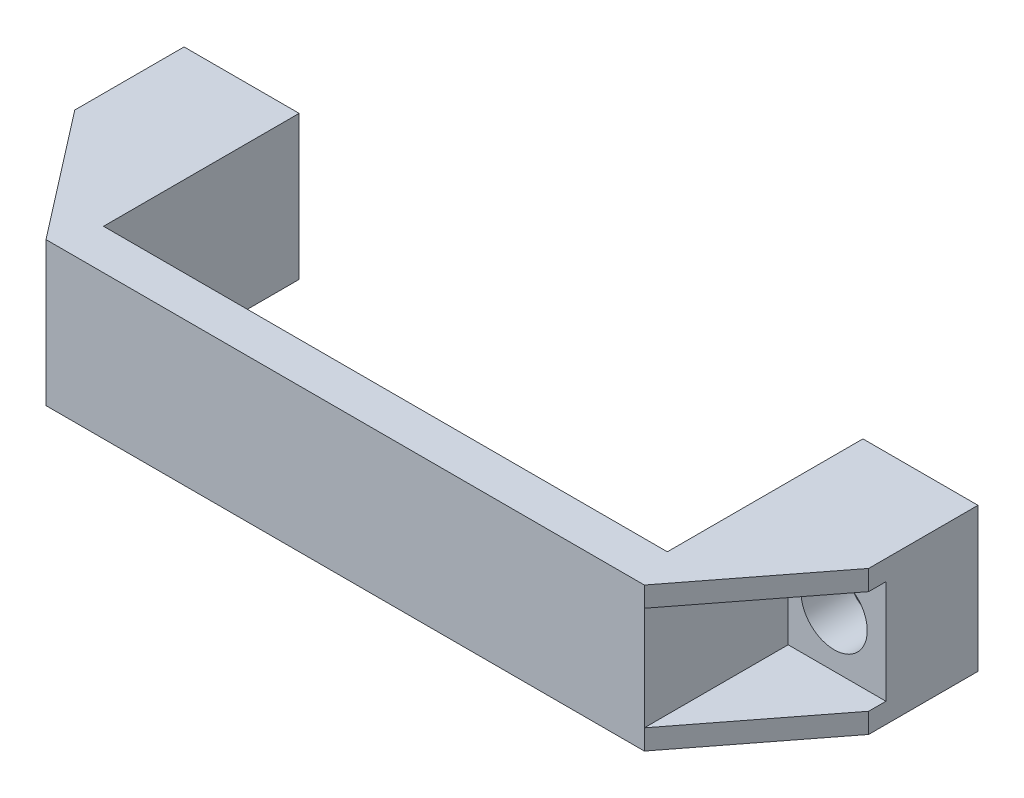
ISO-10303-21;
HEADER;
FILE_DESCRIPTION(('STEP AP214'),'2;1');
FILE_NAME('part.step','',(''),(''),'','','');
FILE_SCHEMA(('AUTOMOTIVE_DESIGN { 1 0 10303 214 1 1 1 1 }'));
ENDSEC;
DATA;
#1=APPLICATION_CONTEXT('core data for automotive mechanical design processes');
#2=APPLICATION_PROTOCOL_DEFINITION('international standard','automotive_design',2000,#1);
#3=PRODUCT_CONTEXT('',#1,'mechanical');
#4=PRODUCT('Part','Part','',(#3));
#5=PRODUCT_RELATED_PRODUCT_CATEGORY('part','',(#4));
#6=PRODUCT_DEFINITION_FORMATION('','',#4);
#7=PRODUCT_DEFINITION_CONTEXT('part definition',#1,'design');
#8=PRODUCT_DEFINITION('design','',#6,#7);
#9=PRODUCT_DEFINITION_SHAPE('','',#8);
#10=(LENGTH_UNIT() NAMED_UNIT(*) SI_UNIT(.MILLI.,.METRE.));
#11=(NAMED_UNIT(*) PLANE_ANGLE_UNIT() SI_UNIT($,.RADIAN.));
#12=(NAMED_UNIT(*) SI_UNIT($,.STERADIAN.) SOLID_ANGLE_UNIT());
#13=UNCERTAINTY_MEASURE_WITH_UNIT(LENGTH_MEASURE(1.E-05),#10,'distance_accuracy_value','');
#14=(GEOMETRIC_REPRESENTATION_CONTEXT(3) GLOBAL_UNCERTAINTY_ASSIGNED_CONTEXT((#13)) GLOBAL_UNIT_ASSIGNED_CONTEXT((#10,
#11,#12)) REPRESENTATION_CONTEXT('',''));
#15=CARTESIAN_POINT('',(0.,0.,0.));
#16=DIRECTION('',(0.,0.,1.));
#17=DIRECTION('',(1.,0.,0.));
#18=AXIS2_PLACEMENT_3D('',#15,#16,#17);
#19=CARTESIAN_POINT('',(60.,0.,20.5));
#20=DIRECTION('',(0.,0.,-1.));
#21=DIRECTION('',(-1.,0.,0.));
#22=AXIS2_PLACEMENT_3D('',#19,#20,#21);
#23=CYLINDRICAL_SURFACE('',#22,3.25);
#24=CARTESIAN_POINT('',(60.,0.,-20.5));
#25=DIRECTION('',(0.,0.,-1.));
#26=DIRECTION('',(-1.,0.,0.));
#27=AXIS2_PLACEMENT_3D('',#24,#25,#26);
#28=CIRCLE('',#27,3.25);
#29=CARTESIAN_POINT('',(56.75,0.,-20.5));
#30=VERTEX_POINT('',#29);
#31=EDGE_CURVE('E215',#30,#30,#28,.T.);
#32=ORIENTED_EDGE('',*,*,#31,.T.);
#33=EDGE_LOOP('',(#32));
#34=FACE_BOUND('',#33,.T.);
#35=CARTESIAN_POINT('',(60.,0.,-12.5));
#36=DIRECTION('',(0.,0.,1.));
#37=DIRECTION('',(1.,0.,0.));
#38=AXIS2_PLACEMENT_3D('',#35,#36,#37);
#39=CIRCLE('',#38,3.25);
#40=CARTESIAN_POINT('',(63.25,0.,-12.5));
#41=VERTEX_POINT('',#40);
#42=EDGE_CURVE('E37',#41,#41,#39,.F.);
#43=ORIENTED_EDGE('',*,*,#42,.F.);
#44=EDGE_LOOP('',(#43));
#45=FACE_BOUND('',#44,.T.);
#46=ADVANCED_FACE('F33',(#34,#45),#23,.F.);
#47=CARTESIAN_POINT('',(-60.,0.,20.5));
#48=DIRECTION('',(0.,0.,-1.));
#49=DIRECTION('',(-1.,0.,0.));
#50=AXIS2_PLACEMENT_3D('',#47,#48,#49);
#51=CYLINDRICAL_SURFACE('',#50,3.25000000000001);
#52=CARTESIAN_POINT('',(-60.,0.,-20.5));
#53=DIRECTION('',(0.,0.,-1.));
#54=DIRECTION('',(-1.,0.,0.));
#55=AXIS2_PLACEMENT_3D('',#52,#53,#54);
#56=CIRCLE('',#55,3.25000000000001);
#57=CARTESIAN_POINT('',(-63.25,0.,-20.5));
#58=VERTEX_POINT('',#57);
#59=EDGE_CURVE('E208',#58,#58,#56,.T.);
#60=ORIENTED_EDGE('',*,*,#59,.T.);
#61=EDGE_LOOP('',(#60));
#62=FACE_BOUND('',#61,.T.);
#63=CARTESIAN_POINT('',(-60.,0.,-12.5));
#64=DIRECTION('',(0.,0.,1.));
#65=DIRECTION('',(1.,0.,0.));
#66=AXIS2_PLACEMENT_3D('',#63,#64,#65);
#67=CIRCLE('',#66,3.25000000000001);
#68=CARTESIAN_POINT('',(-56.75,0.,-12.5));
#69=VERTEX_POINT('',#68);
#70=EDGE_CURVE('E303',#69,#69,#67,.F.);
#71=ORIENTED_EDGE('',*,*,#70,.F.);
#72=EDGE_LOOP('',(#71));
#73=FACE_BOUND('',#72,.T.);
#74=ADVANCED_FACE('F386',(#62,#73),#51,.F.);
#75=CARTESIAN_POINT('',(69.,12.5,20.5));
#76=DIRECTION('',(-1.,0.,0.));
#77=DIRECTION('',(0.,0.,1.));
#78=AXIS2_PLACEMENT_3D('',#75,#76,#77);
#79=PLANE('',#78);
#80=DIRECTION('',(0.,0.,1.));
#81=VECTOR('',#80,1.);
#82=CARTESIAN_POINT('',(69.,-9.00000000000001,-4.5));
#83=LINE('',#82,#81);
#84=CARTESIAN_POINT('',(69.,-9.00000000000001,-4.5));
#85=VERTEX_POINT('',#84);
#86=CARTESIAN_POINT('',(69.,-9.00000000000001,-1.49999999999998));
#87=VERTEX_POINT('',#86);
#88=EDGE_CURVE('E204',#85,#87,#83,.T.);
#89=ORIENTED_EDGE('',*,*,#88,.T.);
#90=DIRECTION('',(0.,-1.,0.));
#91=VECTOR('',#90,1.);
#92=CARTESIAN_POINT('',(69.,12.5,-1.49999999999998));
#93=LINE('',#92,#91);
#94=CARTESIAN_POINT('',(69.,-12.5,-1.49999999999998));
#95=VERTEX_POINT('',#94);
#96=EDGE_CURVE('E227',#87,#95,#93,.T.);
#97=ORIENTED_EDGE('',*,*,#96,.T.);
#98=DIRECTION('',(0.,0.,-1.));
#99=VECTOR('',#98,1.);
#100=CARTESIAN_POINT('',(69.,-12.5,20.5));
#101=LINE('',#100,#99);
#102=CARTESIAN_POINT('',(69.,-12.5,-20.5));
#103=VERTEX_POINT('',#102);
#104=EDGE_CURVE('E293',#95,#103,#101,.T.);
#105=ORIENTED_EDGE('',*,*,#104,.T.);
#106=DIRECTION('',(0.,1.,0.));
#107=VECTOR('',#106,1.);
#108=CARTESIAN_POINT('',(69.,12.5,-20.5));
#109=LINE('',#108,#107);
#110=CARTESIAN_POINT('',(69.,12.5,-20.5));
#111=VERTEX_POINT('',#110);
#112=EDGE_CURVE('E284',#103,#111,#109,.T.);
#113=ORIENTED_EDGE('',*,*,#112,.T.);
#114=DIRECTION('',(0.,0.,-1.));
#115=VECTOR('',#114,1.);
#116=CARTESIAN_POINT('',(69.,12.5,20.5));
#117=LINE('',#116,#115);
#118=CARTESIAN_POINT('',(69.,12.5,-1.49999999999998));
#119=VERTEX_POINT('',#118);
#120=EDGE_CURVE('E291',#119,#111,#117,.T.);
#121=ORIENTED_EDGE('',*,*,#120,.F.);
#122=CARTESIAN_POINT('',(69.,8.99999999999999,-1.49999999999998));
#123=VERTEX_POINT('',#122);
#124=EDGE_CURVE('E182',#119,#123,#93,.T.);
#125=ORIENTED_EDGE('',*,*,#124,.T.);
#126=DIRECTION('',(0.,0.,1.));
#127=VECTOR('',#126,1.);
#128=CARTESIAN_POINT('',(69.,8.99999999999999,-4.5));
#129=LINE('',#128,#127);
#130=CARTESIAN_POINT('',(69.,8.99999999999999,-4.5));
#131=VERTEX_POINT('',#130);
#132=EDGE_CURVE('E164',#131,#123,#129,.T.);
#133=ORIENTED_EDGE('',*,*,#132,.F.);
#134=DIRECTION('',(0.,-1.,0.));
#135=VECTOR('',#134,1.);
#136=CARTESIAN_POINT('',(69.,8.99999999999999,-4.5));
#137=LINE('',#136,#135);
#138=EDGE_CURVE('E169',#131,#85,#137,.T.);
#139=ORIENTED_EDGE('',*,*,#138,.T.);
#140=EDGE_LOOP('',(#89,#97,#105,#113,#121,#125,#133,#139));
#141=FACE_BOUND('',#140,.T.);
#142=ADVANCED_FACE('F180',(#141),#79,.F.);
#143=CARTESIAN_POINT('',(69.,12.5,-1.49999999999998));
#144=DIRECTION('',(-0.791285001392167,0.,-0.611447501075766));
#145=DIRECTION('',(-0.611447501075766,0.,0.791285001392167));
#146=AXIS2_PLACEMENT_3D('',#143,#144,#145);
#147=PLANE('',#146);
#148=DIRECTION('',(0.611447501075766,0.,-0.791285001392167));
#149=VECTOR('',#148,1.);
#150=CARTESIAN_POINT('',(69.,-9.00000000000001,-1.49999999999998));
#151=LINE('',#150,#149);
#152=CARTESIAN_POINT('',(52.,-9.00000000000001,20.5));
#153=VERTEX_POINT('',#152);
#154=EDGE_CURVE('E11',#153,#87,#151,.T.);
#155=ORIENTED_EDGE('',*,*,#154,.F.);
#156=DIRECTION('',(0.,-1.,0.));
#157=VECTOR('',#156,1.);
#158=CARTESIAN_POINT('',(52.,12.5,20.5));
#159=LINE('',#158,#157);
#160=CARTESIAN_POINT('',(52.,-12.5,20.5));
#161=VERTEX_POINT('',#160);
#162=EDGE_CURVE('E222',#153,#161,#159,.T.);
#163=ORIENTED_EDGE('',*,*,#162,.T.);
#164=DIRECTION('',(0.611447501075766,0.,-0.791285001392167));
#165=VECTOR('',#164,1.);
#166=CARTESIAN_POINT('',(69.,-12.5,-1.49999999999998));
#167=LINE('',#166,#165);
#168=EDGE_CURVE('E218',#161,#95,#167,.T.);
#169=ORIENTED_EDGE('',*,*,#168,.T.);
#170=ORIENTED_EDGE('',*,*,#96,.F.);
#171=EDGE_LOOP('',(#155,#163,#169,#170));
#172=FACE_BOUND('',#171,.T.);
#173=ADVANCED_FACE('F332',(#172),#147,.F.);
#174=DIRECTION('',(-0.611447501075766,0.,0.791285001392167));
#175=VECTOR('',#174,1.);
#176=CARTESIAN_POINT('',(69.,8.99999999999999,-1.49999999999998));
#177=LINE('',#176,#175);
#178=CARTESIAN_POINT('',(52.,8.99999999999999,20.5));
#179=VERTEX_POINT('',#178);
#180=EDGE_CURVE('E42',#123,#179,#177,.T.);
#181=ORIENTED_EDGE('',*,*,#180,.F.);
#182=ORIENTED_EDGE('',*,*,#124,.F.);
#183=DIRECTION('',(0.611447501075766,0.,-0.791285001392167));
#184=VECTOR('',#183,1.);
#185=CARTESIAN_POINT('',(69.,12.5,-1.49999999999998));
#186=LINE('',#185,#184);
#187=CARTESIAN_POINT('',(52.,12.5,20.5));
#188=VERTEX_POINT('',#187);
#189=EDGE_CURVE('E219',#188,#119,#186,.T.);
#190=ORIENTED_EDGE('',*,*,#189,.F.);
#191=EDGE_CURVE('E228',#188,#179,#159,.T.);
#192=ORIENTED_EDGE('',*,*,#191,.T.);
#193=EDGE_LOOP('',(#181,#182,#190,#192));
#194=FACE_BOUND('',#193,.T.);
#195=ADVANCED_FACE('F355',(#194),#147,.F.);
#196=CARTESIAN_POINT('',(-69.,12.5,-1.5));
#197=DIRECTION('',(0.791285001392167,0.,-0.611447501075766));
#198=DIRECTION('',(-0.611447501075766,0.,-0.791285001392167));
#199=AXIS2_PLACEMENT_3D('',#196,#197,#198);
#200=PLANE('',#199);
#201=DIRECTION('',(0.,-1.,0.));
#202=VECTOR('',#201,1.);
#203=CARTESIAN_POINT('',(-69.,12.5,-1.5));
#204=LINE('',#203,#202);
#205=CARTESIAN_POINT('',(-69.,12.5,-1.5));
#206=VERTEX_POINT('',#205);
#207=CARTESIAN_POINT('',(-69.,8.99999999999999,-1.5));
#208=VERTEX_POINT('',#207);
#209=EDGE_CURVE('E237',#206,#208,#204,.T.);
#210=ORIENTED_EDGE('',*,*,#209,.T.);
#211=DIRECTION('',(0.611447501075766,0.,0.791285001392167));
#212=VECTOR('',#211,1.);
#213=CARTESIAN_POINT('',(-69.,8.99999999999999,-1.5));
#214=LINE('',#213,#212);
#215=CARTESIAN_POINT('',(-52.,8.99999999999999,20.5));
#216=VERTEX_POINT('',#215);
#217=EDGE_CURVE('E300',#208,#216,#214,.T.);
#218=ORIENTED_EDGE('',*,*,#217,.T.);
#219=DIRECTION('',(0.,-1.,0.));
#220=VECTOR('',#219,1.);
#221=CARTESIAN_POINT('',(-52.,12.5,20.5));
#222=LINE('',#221,#220);
#223=CARTESIAN_POINT('',(-52.,12.5,20.5));
#224=VERTEX_POINT('',#223);
#225=EDGE_CURVE('E242',#224,#216,#222,.T.);
#226=ORIENTED_EDGE('',*,*,#225,.F.);
#227=DIRECTION('',(0.611447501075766,0.,0.791285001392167));
#228=VECTOR('',#227,1.);
#229=CARTESIAN_POINT('',(-69.,12.5,-1.5));
#230=LINE('',#229,#228);
#231=EDGE_CURVE('E231',#206,#224,#230,.T.);
#232=ORIENTED_EDGE('',*,*,#231,.F.);
#233=EDGE_LOOP('',(#210,#218,#226,#232));
#234=FACE_BOUND('',#233,.T.);
#235=ADVANCED_FACE('F358',(#234),#200,.F.);
#236=CARTESIAN_POINT('',(0.,0.,-20.5));
#237=DIRECTION('',(0.,0.,1.));
#238=DIRECTION('',(1.,0.,0.));
#239=AXIS2_PLACEMENT_3D('',#236,#237,#238);
#240=PLANE('',#239);
#241=ORIENTED_EDGE('',*,*,#59,.F.);
#242=EDGE_LOOP('',(#241));
#243=FACE_BOUND('',#242,.T.);
#244=DIRECTION('',(-1.,0.,0.));
#245=VECTOR('',#244,1.);
#246=CARTESIAN_POINT('',(-69.,12.5,-20.5));
#247=LINE('',#246,#245);
#248=CARTESIAN_POINT('',(-49.,12.5,-20.5));
#249=VERTEX_POINT('',#248);
#250=CARTESIAN_POINT('',(-69.,12.5,-20.5));
#251=VERTEX_POINT('',#250);
#252=EDGE_CURVE('E287',#249,#251,#247,.T.);
#253=ORIENTED_EDGE('',*,*,#252,.F.);
#254=DIRECTION('',(0.,-1.,0.));
#255=VECTOR('',#254,1.);
#256=CARTESIAN_POINT('',(-49.,12.5,-20.5));
#257=LINE('',#256,#255);
#258=CARTESIAN_POINT('',(-49.,-12.5,-20.5));
#259=VERTEX_POINT('',#258);
#260=EDGE_CURVE('E255',#249,#259,#257,.T.);
#261=ORIENTED_EDGE('',*,*,#260,.T.);
#262=DIRECTION('',(1.,0.,0.));
#263=VECTOR('',#262,1.);
#264=CARTESIAN_POINT('',(-69.,-12.5,-20.5));
#265=LINE('',#264,#263);
#266=CARTESIAN_POINT('',(-69.,-12.5,-20.5));
#267=VERTEX_POINT('',#266);
#268=EDGE_CURVE('E281',#267,#259,#265,.T.);
#269=ORIENTED_EDGE('',*,*,#268,.F.);
#270=DIRECTION('',(0.,-1.,0.));
#271=VECTOR('',#270,1.);
#272=CARTESIAN_POINT('',(-69.,12.5,-20.5));
#273=LINE('',#272,#271);
#274=EDGE_CURVE('E264',#251,#267,#273,.T.);
#275=ORIENTED_EDGE('',*,*,#274,.F.);
#276=EDGE_LOOP('',(#253,#261,#269,#275));
#277=FACE_BOUND('',#276,.T.);
#278=ADVANCED_FACE('F419',(#243,#277),#240,.F.);
#279=CARTESIAN_POINT('',(-69.,12.5,20.5));
#280=DIRECTION('',(1.,0.,0.));
#281=DIRECTION('',(0.,0.,-1.));
#282=AXIS2_PLACEMENT_3D('',#279,#280,#281);
#283=PLANE('',#282);
#284=DIRECTION('',(0.,-1.,0.));
#285=VECTOR('',#284,1.);
#286=CARTESIAN_POINT('',(-69.,8.99999999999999,-4.5));
#287=LINE('',#286,#285);
#288=CARTESIAN_POINT('',(-69.,8.99999999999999,-4.5));
#289=VERTEX_POINT('',#288);
#290=CARTESIAN_POINT('',(-69.,-9.00000000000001,-4.5));
#291=VERTEX_POINT('',#290);
#292=EDGE_CURVE('E189',#289,#291,#287,.T.);
#293=ORIENTED_EDGE('',*,*,#292,.F.);
#294=DIRECTION('',(0.,0.,1.));
#295=VECTOR('',#294,1.);
#296=CARTESIAN_POINT('',(-69.,8.99999999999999,-4.5));
#297=LINE('',#296,#295);
#298=EDGE_CURVE('E205',#289,#208,#297,.T.);
#299=ORIENTED_EDGE('',*,*,#298,.T.);
#300=ORIENTED_EDGE('',*,*,#209,.F.);
#301=DIRECTION('',(0.,0.,-1.));
#302=VECTOR('',#301,1.);
#303=CARTESIAN_POINT('',(-69.,12.5,20.5));
#304=LINE('',#303,#302);
#305=EDGE_CURVE('E277',#206,#251,#304,.T.);
#306=ORIENTED_EDGE('',*,*,#305,.T.);
#307=ORIENTED_EDGE('',*,*,#274,.T.);
#308=DIRECTION('',(0.,0.,-1.));
#309=VECTOR('',#308,1.);
#310=CARTESIAN_POINT('',(-69.,-12.5,20.5));
#311=LINE('',#310,#309);
#312=CARTESIAN_POINT('',(-69.,-12.5,-1.5));
#313=VERTEX_POINT('',#312);
#314=EDGE_CURVE('E295',#313,#267,#311,.T.);
#315=ORIENTED_EDGE('',*,*,#314,.F.);
#316=CARTESIAN_POINT('',(-69.,-9.00000000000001,-1.5));
#317=VERTEX_POINT('',#316);
#318=EDGE_CURVE('E241',#317,#313,#204,.T.);
#319=ORIENTED_EDGE('',*,*,#318,.F.);
#320=DIRECTION('',(0.,0.,1.));
#321=VECTOR('',#320,1.);
#322=CARTESIAN_POINT('',(-69.,-9.00000000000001,-4.5));
#323=LINE('',#322,#321);
#324=EDGE_CURVE('E202',#291,#317,#323,.T.);
#325=ORIENTED_EDGE('',*,*,#324,.F.);
#326=EDGE_LOOP('',(#293,#299,#300,#306,#307,#315,#319,#325));
#327=FACE_BOUND('',#326,.T.);
#328=ADVANCED_FACE('F35',(#327),#283,.F.);
#329=CARTESIAN_POINT('',(-69.,-12.5,20.5));
#330=DIRECTION('',(0.,1.,0.));
#331=DIRECTION('',(-1.,0.,0.));
#332=AXIS2_PLACEMENT_3D('',#329,#330,#331);
#333=PLANE('',#332);
#334=ORIENTED_EDGE('',*,*,#104,.F.);
#335=ORIENTED_EDGE('',*,*,#168,.F.);
#336=DIRECTION('',(1.,0.,0.));
#337=VECTOR('',#336,1.);
#338=CARTESIAN_POINT('',(-69.,-12.5,20.5));
#339=LINE('',#338,#337);
#340=CARTESIAN_POINT('',(-52.,-12.5,20.5));
#341=VERTEX_POINT('',#340);
#342=EDGE_CURVE('E271',#341,#161,#339,.T.);
#343=ORIENTED_EDGE('',*,*,#342,.F.);
#344=DIRECTION('',(0.611447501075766,0.,0.791285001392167));
#345=VECTOR('',#344,1.);
#346=CARTESIAN_POINT('',(-69.,-12.5,-1.5));
#347=LINE('',#346,#345);
#348=EDGE_CURVE('E226',#313,#341,#347,.T.);
#349=ORIENTED_EDGE('',*,*,#348,.F.);
#350=ORIENTED_EDGE('',*,*,#314,.T.);
#351=ORIENTED_EDGE('',*,*,#268,.T.);
#352=DIRECTION('',(0.,0.,-1.));
#353=VECTOR('',#352,1.);
#354=CARTESIAN_POINT('',(-49.,-12.5,13.5));
#355=LINE('',#354,#353);
#356=CARTESIAN_POINT('',(-49.,-12.5,13.5));
#357=VERTEX_POINT('',#356);
#358=EDGE_CURVE('E240',#357,#259,#355,.T.);
#359=ORIENTED_EDGE('',*,*,#358,.F.);
#360=DIRECTION('',(-1.,0.,0.));
#361=VECTOR('',#360,1.);
#362=CARTESIAN_POINT('',(-49.,-12.5,13.5));
#363=LINE('',#362,#361);
#364=CARTESIAN_POINT('',(49.,-12.5,13.5));
#365=VERTEX_POINT('',#364);
#366=EDGE_CURVE('E249',#365,#357,#363,.T.);
#367=ORIENTED_EDGE('',*,*,#366,.F.);
#368=DIRECTION('',(0.,0.,1.));
#369=VECTOR('',#368,1.);
#370=CARTESIAN_POINT('',(49.,-12.5,13.5));
#371=LINE('',#370,#369);
#372=CARTESIAN_POINT('',(49.,-12.5,-20.5));
#373=VERTEX_POINT('',#372);
#374=EDGE_CURVE('E257',#373,#365,#371,.T.);
#375=ORIENTED_EDGE('',*,*,#374,.F.);
#376=EDGE_CURVE('E280',#373,#103,#265,.T.);
#377=ORIENTED_EDGE('',*,*,#376,.T.);
#378=EDGE_LOOP('',(#334,#335,#343,#349,#350,#351,#359,#367,#375,#377));
#379=FACE_BOUND('',#378,.T.);
#380=ADVANCED_FACE('F341',(#379),#333,.F.);
#381=CARTESIAN_POINT('',(-69.,12.5,20.5));
#382=DIRECTION('',(0.,-1.,0.));
#383=DIRECTION('',(1.,0.,0.));
#384=AXIS2_PLACEMENT_3D('',#381,#382,#383);
#385=PLANE('',#384);
#386=DIRECTION('',(-1.,0.,0.));
#387=VECTOR('',#386,1.);
#388=CARTESIAN_POINT('',(-69.,12.5,20.5));
#389=LINE('',#388,#387);
#390=EDGE_CURVE('E274',#188,#224,#389,.T.);
#391=ORIENTED_EDGE('',*,*,#390,.F.);
#392=ORIENTED_EDGE('',*,*,#189,.T.);
#393=ORIENTED_EDGE('',*,*,#120,.T.);
#394=CARTESIAN_POINT('',(49.,12.5,-20.5));
#395=VERTEX_POINT('',#394);
#396=EDGE_CURVE('E275',#111,#395,#247,.T.);
#397=ORIENTED_EDGE('',*,*,#396,.T.);
#398=DIRECTION('',(0.,0.,1.));
#399=VECTOR('',#398,1.);
#400=CARTESIAN_POINT('',(49.,12.5,13.5));
#401=LINE('',#400,#399);
#402=CARTESIAN_POINT('',(49.,12.5,13.5));
#403=VERTEX_POINT('',#402);
#404=EDGE_CURVE('E248',#395,#403,#401,.T.);
#405=ORIENTED_EDGE('',*,*,#404,.T.);
#406=DIRECTION('',(-1.,0.,0.));
#407=VECTOR('',#406,1.);
#408=CARTESIAN_POINT('',(-49.,12.5,13.5));
#409=LINE('',#408,#407);
#410=CARTESIAN_POINT('',(-49.,12.5,13.5));
#411=VERTEX_POINT('',#410);
#412=EDGE_CURVE('E252',#403,#411,#409,.T.);
#413=ORIENTED_EDGE('',*,*,#412,.T.);
#414=DIRECTION('',(0.,0.,-1.));
#415=VECTOR('',#414,1.);
#416=CARTESIAN_POINT('',(-49.,12.5,13.5));
#417=LINE('',#416,#415);
#418=EDGE_CURVE('E245',#411,#249,#417,.T.);
#419=ORIENTED_EDGE('',*,*,#418,.T.);
#420=ORIENTED_EDGE('',*,*,#252,.T.);
#421=ORIENTED_EDGE('',*,*,#305,.F.);
#422=ORIENTED_EDGE('',*,*,#231,.T.);
#423=EDGE_LOOP('',(#391,#392,#393,#397,#405,#413,#419,#420,#421,#422));
#424=FACE_BOUND('',#423,.T.);
#425=ADVANCED_FACE('F353',(#424),#385,.F.);
#426=CARTESIAN_POINT('',(0.,0.,20.5));
#427=DIRECTION('',(0.,0.,1.));
#428=DIRECTION('',(1.,0.,0.));
#429=AXIS2_PLACEMENT_3D('',#426,#427,#428);
#430=PLANE('',#429);
#431=ORIENTED_EDGE('',*,*,#191,.F.);
#432=ORIENTED_EDGE('',*,*,#390,.T.);
#433=ORIENTED_EDGE('',*,*,#225,.T.);
#434=DIRECTION('',(0.,1.,0.));
#435=VECTOR('',#434,1.);
#436=CARTESIAN_POINT('',(-52.,8.99999999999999,20.5));
#437=LINE('',#436,#435);
#438=CARTESIAN_POINT('',(-52.,-9.00000000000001,20.5));
#439=VERTEX_POINT('',#438);
#440=EDGE_CURVE('E193',#439,#216,#437,.T.);
#441=ORIENTED_EDGE('',*,*,#440,.F.);
#442=EDGE_CURVE('E234',#439,#341,#222,.T.);
#443=ORIENTED_EDGE('',*,*,#442,.T.);
#444=ORIENTED_EDGE('',*,*,#342,.T.);
#445=ORIENTED_EDGE('',*,*,#162,.F.);
#446=DIRECTION('',(0.,1.,0.));
#447=VECTOR('',#446,1.);
#448=CARTESIAN_POINT('',(52.,8.99999999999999,20.5));
#449=LINE('',#448,#447);
#450=EDGE_CURVE('E177',#153,#179,#449,.T.);
#451=ORIENTED_EDGE('',*,*,#450,.T.);
#452=EDGE_LOOP('',(#431,#432,#433,#441,#443,#444,#445,#451));
#453=FACE_BOUND('',#452,.T.);
#454=ADVANCED_FACE('F334',(#453),#430,.T.);
#455=ORIENTED_EDGE('',*,*,#31,.F.);
#456=EDGE_LOOP('',(#455));
#457=FACE_BOUND('',#456,.T.);
#458=ORIENTED_EDGE('',*,*,#376,.F.);
#459=DIRECTION('',(0.,-1.,0.));
#460=VECTOR('',#459,1.);
#461=CARTESIAN_POINT('',(49.,12.5,-20.5));
#462=LINE('',#461,#460);
#463=EDGE_CURVE('E267',#395,#373,#462,.T.);
#464=ORIENTED_EDGE('',*,*,#463,.F.);
#465=ORIENTED_EDGE('',*,*,#396,.F.);
#466=ORIENTED_EDGE('',*,*,#112,.F.);
#467=EDGE_LOOP('',(#458,#464,#465,#466));
#468=FACE_BOUND('',#467,.T.);
#469=ADVANCED_FACE('F350',(#457,#468),#240,.F.);
#470=CARTESIAN_POINT('',(-49.,12.5,13.5));
#471=DIRECTION('',(-1.,0.,0.));
#472=DIRECTION('',(0.,-1.,0.));
#473=AXIS2_PLACEMENT_3D('',#470,#471,#472);
#474=PLANE('',#473);
#475=ORIENTED_EDGE('',*,*,#358,.T.);
#476=ORIENTED_EDGE('',*,*,#260,.F.);
#477=ORIENTED_EDGE('',*,*,#418,.F.);
#478=DIRECTION('',(0.,-1.,0.));
#479=VECTOR('',#478,1.);
#480=CARTESIAN_POINT('',(-49.,12.5,13.5));
#481=LINE('',#480,#479);
#482=EDGE_CURVE('E262',#411,#357,#481,.T.);
#483=ORIENTED_EDGE('',*,*,#482,.T.);
#484=EDGE_LOOP('',(#475,#476,#477,#483));
#485=FACE_BOUND('',#484,.T.);
#486=ADVANCED_FACE('F406',(#485),#474,.F.);
#487=CARTESIAN_POINT('',(-49.,12.5,13.5));
#488=DIRECTION('',(0.,0.,1.));
#489=DIRECTION('',(1.,0.,0.));
#490=AXIS2_PLACEMENT_3D('',#487,#488,#489);
#491=PLANE('',#490);
#492=ORIENTED_EDGE('',*,*,#366,.T.);
#493=ORIENTED_EDGE('',*,*,#482,.F.);
#494=ORIENTED_EDGE('',*,*,#412,.F.);
#495=DIRECTION('',(0.,-1.,0.));
#496=VECTOR('',#495,1.);
#497=CARTESIAN_POINT('',(49.,12.5,13.5));
#498=LINE('',#497,#496);
#499=EDGE_CURVE('E265',#403,#365,#498,.T.);
#500=ORIENTED_EDGE('',*,*,#499,.T.);
#501=EDGE_LOOP('',(#492,#493,#494,#500));
#502=FACE_BOUND('',#501,.T.);
#503=ADVANCED_FACE('F403',(#502),#491,.F.);
#504=CARTESIAN_POINT('',(49.,12.5,13.5));
#505=DIRECTION('',(1.,0.,0.));
#506=DIRECTION('',(0.,1.,0.));
#507=AXIS2_PLACEMENT_3D('',#504,#505,#506);
#508=PLANE('',#507);
#509=ORIENTED_EDGE('',*,*,#374,.T.);
#510=ORIENTED_EDGE('',*,*,#499,.F.);
#511=ORIENTED_EDGE('',*,*,#404,.F.);
#512=ORIENTED_EDGE('',*,*,#463,.T.);
#513=EDGE_LOOP('',(#509,#510,#511,#512));
#514=FACE_BOUND('',#513,.T.);
#515=ADVANCED_FACE('F401',(#514),#508,.F.);
#516=ORIENTED_EDGE('',*,*,#442,.F.);
#517=DIRECTION('',(-0.611447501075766,0.,-0.791285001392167));
#518=VECTOR('',#517,1.);
#519=CARTESIAN_POINT('',(-69.,-9.00000000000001,-1.5));
#520=LINE('',#519,#518);
#521=EDGE_CURVE('E297',#439,#317,#520,.T.);
#522=ORIENTED_EDGE('',*,*,#521,.T.);
#523=ORIENTED_EDGE('',*,*,#318,.T.);
#524=ORIENTED_EDGE('',*,*,#348,.T.);
#525=EDGE_LOOP('',(#516,#522,#523,#524));
#526=FACE_BOUND('',#525,.T.);
#527=ADVANCED_FACE('F398',(#526),#200,.F.);
#528=CARTESIAN_POINT('',(-69.,8.99999999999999,-4.5));
#529=DIRECTION('',(0.,1.,0.));
#530=DIRECTION('',(-1.,0.,0.));
#531=AXIS2_PLACEMENT_3D('',#528,#529,#530);
#532=PLANE('',#531);
#533=ORIENTED_EDGE('',*,*,#298,.F.);
#534=DIRECTION('',(-1.,0.,0.));
#535=VECTOR('',#534,1.);
#536=CARTESIAN_POINT('',(-69.,8.99999999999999,-4.5));
#537=LINE('',#536,#535);
#538=CARTESIAN_POINT('',(-52.,8.99999999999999,-4.5));
#539=VERTEX_POINT('',#538);
#540=EDGE_CURVE('E199',#539,#289,#537,.T.);
#541=ORIENTED_EDGE('',*,*,#540,.F.);
#542=DIRECTION('',(0.,0.,1.));
#543=VECTOR('',#542,1.);
#544=CARTESIAN_POINT('',(-52.,8.99999999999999,-4.5));
#545=LINE('',#544,#543);
#546=EDGE_CURVE('E209',#539,#216,#545,.T.);
#547=ORIENTED_EDGE('',*,*,#546,.T.);
#548=ORIENTED_EDGE('',*,*,#217,.F.);
#549=EDGE_LOOP('',(#533,#541,#547,#548));
#550=FACE_BOUND('',#549,.T.);
#551=ADVANCED_FACE('F369',(#550),#532,.F.);
#552=CARTESIAN_POINT('',(-69.,-9.00000000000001,-4.5));
#553=DIRECTION('',(0.,-1.,0.));
#554=DIRECTION('',(1.,0.,0.));
#555=AXIS2_PLACEMENT_3D('',#552,#553,#554);
#556=PLANE('',#555);
#557=DIRECTION('',(0.,0.,1.));
#558=VECTOR('',#557,1.);
#559=CARTESIAN_POINT('',(-52.,-9.00000000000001,-4.5));
#560=LINE('',#559,#558);
#561=CARTESIAN_POINT('',(-52.,-9.00000000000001,-4.5));
#562=VERTEX_POINT('',#561);
#563=EDGE_CURVE('E58',#562,#439,#560,.T.);
#564=ORIENTED_EDGE('',*,*,#563,.F.);
#565=DIRECTION('',(1.,0.,0.));
#566=VECTOR('',#565,1.);
#567=CARTESIAN_POINT('',(-69.,-9.00000000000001,-4.5));
#568=LINE('',#567,#566);
#569=EDGE_CURVE('E192',#291,#562,#568,.T.);
#570=ORIENTED_EDGE('',*,*,#569,.F.);
#571=ORIENTED_EDGE('',*,*,#324,.T.);
#572=ORIENTED_EDGE('',*,*,#521,.F.);
#573=EDGE_LOOP('',(#564,#570,#571,#572));
#574=FACE_BOUND('',#573,.T.);
#575=ADVANCED_FACE('F380',(#574),#556,.F.);
#576=CARTESIAN_POINT('',(0.,0.,-4.5));
#577=DIRECTION('',(0.,0.,1.));
#578=DIRECTION('',(1.,0.,0.));
#579=AXIS2_PLACEMENT_3D('',#576,#577,#578);
#580=PLANE('',#579);
#581=CARTESIAN_POINT('',(-60.,0.,-4.5));
#582=DIRECTION('',(0.,0.,1.));
#583=DIRECTION('',(1.,0.,0.));
#584=AXIS2_PLACEMENT_3D('',#581,#582,#583);
#585=CIRCLE('',#584,5.75);
#586=CARTESIAN_POINT('',(-54.25,0.,-4.5));
#587=VERTEX_POINT('',#586);
#588=EDGE_CURVE('E311',#587,#587,#585,.T.);
#589=ORIENTED_EDGE('',*,*,#588,.F.);
#590=EDGE_LOOP('',(#589));
#591=FACE_BOUND('',#590,.T.);
#592=ORIENTED_EDGE('',*,*,#292,.T.);
#593=ORIENTED_EDGE('',*,*,#569,.T.);
#594=DIRECTION('',(0.,1.,0.));
#595=VECTOR('',#594,1.);
#596=CARTESIAN_POINT('',(-52.,8.99999999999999,-4.5));
#597=LINE('',#596,#595);
#598=EDGE_CURVE('E196',#562,#539,#597,.T.);
#599=ORIENTED_EDGE('',*,*,#598,.T.);
#600=ORIENTED_EDGE('',*,*,#540,.T.);
#601=EDGE_LOOP('',(#592,#593,#599,#600));
#602=FACE_BOUND('',#601,.T.);
#603=ADVANCED_FACE('F371',(#591,#602),#580,.T.);
#604=CARTESIAN_POINT('',(-52.,8.99999999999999,-4.5));
#605=DIRECTION('',(1.,0.,0.));
#606=DIRECTION('',(0.,0.,-1.));
#607=AXIS2_PLACEMENT_3D('',#604,#605,#606);
#608=PLANE('',#607);
#609=ORIENTED_EDGE('',*,*,#440,.T.);
#610=ORIENTED_EDGE('',*,*,#546,.F.);
#611=ORIENTED_EDGE('',*,*,#598,.F.);
#612=ORIENTED_EDGE('',*,*,#563,.T.);
#613=EDGE_LOOP('',(#609,#610,#611,#612));
#614=FACE_BOUND('',#613,.T.);
#615=ADVANCED_FACE('F372',(#614),#608,.F.);
#616=CARTESIAN_POINT('',(69.,-9.00000000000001,-4.5));
#617=DIRECTION('',(0.,1.,0.));
#618=DIRECTION('',(-1.,0.,0.));
#619=AXIS2_PLACEMENT_3D('',#616,#617,#618);
#620=PLANE('',#619);
#621=ORIENTED_EDGE('',*,*,#154,.T.);
#622=ORIENTED_EDGE('',*,*,#88,.F.);
#623=DIRECTION('',(-1.,0.,0.));
#624=VECTOR('',#623,1.);
#625=CARTESIAN_POINT('',(69.,-9.00000000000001,-4.5));
#626=LINE('',#625,#624);
#627=CARTESIAN_POINT('',(52.,-9.00000000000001,-4.5));
#628=VERTEX_POINT('',#627);
#629=EDGE_CURVE('E173',#85,#628,#626,.T.);
#630=ORIENTED_EDGE('',*,*,#629,.T.);
#631=DIRECTION('',(0.,0.,1.));
#632=VECTOR('',#631,1.);
#633=CARTESIAN_POINT('',(52.,-9.00000000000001,-4.5));
#634=LINE('',#633,#632);
#635=EDGE_CURVE('E184',#628,#153,#634,.T.);
#636=ORIENTED_EDGE('',*,*,#635,.T.);
#637=EDGE_LOOP('',(#621,#622,#630,#636));
#638=FACE_BOUND('',#637,.T.);
#639=ADVANCED_FACE('F324',(#638),#620,.T.);
#640=CARTESIAN_POINT('',(69.,8.99999999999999,-4.5));
#641=DIRECTION('',(0.,-1.,0.));
#642=DIRECTION('',(1.,0.,0.));
#643=AXIS2_PLACEMENT_3D('',#640,#641,#642);
#644=PLANE('',#643);
#645=ORIENTED_EDGE('',*,*,#180,.T.);
#646=DIRECTION('',(0.,0.,1.));
#647=VECTOR('',#646,1.);
#648=CARTESIAN_POINT('',(52.,8.99999999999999,-4.5));
#649=LINE('',#648,#647);
#650=CARTESIAN_POINT('',(52.,8.99999999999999,-4.5));
#651=VERTEX_POINT('',#650);
#652=EDGE_CURVE('E50',#651,#179,#649,.T.);
#653=ORIENTED_EDGE('',*,*,#652,.F.);
#654=DIRECTION('',(1.,0.,0.));
#655=VECTOR('',#654,1.);
#656=CARTESIAN_POINT('',(69.,8.99999999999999,-4.5));
#657=LINE('',#656,#655);
#658=EDGE_CURVE('E160',#651,#131,#657,.T.);
#659=ORIENTED_EDGE('',*,*,#658,.T.);
#660=ORIENTED_EDGE('',*,*,#132,.T.);
#661=EDGE_LOOP('',(#645,#653,#659,#660));
#662=FACE_BOUND('',#661,.T.);
#663=ADVANCED_FACE('F162',(#662),#644,.T.);
#664=CARTESIAN_POINT('',(0.,0.,-4.5));
#665=DIRECTION('',(0.,0.,1.));
#666=DIRECTION('',(-1.,0.,0.));
#667=AXIS2_PLACEMENT_3D('',#664,#665,#666);
#668=PLANE('',#667);
#669=CARTESIAN_POINT('',(60.,0.,-4.5));
#670=DIRECTION('',(0.,0.,1.));
#671=DIRECTION('',(1.,0.,0.));
#672=AXIS2_PLACEMENT_3D('',#669,#670,#671);
#673=CIRCLE('',#672,5.75);
#674=CARTESIAN_POINT('',(65.75,0.,-4.5));
#675=VERTEX_POINT('',#674);
#676=EDGE_CURVE('E318',#675,#675,#673,.T.);
#677=ORIENTED_EDGE('',*,*,#676,.F.);
#678=EDGE_LOOP('',(#677));
#679=FACE_BOUND('',#678,.T.);
#680=ORIENTED_EDGE('',*,*,#138,.F.);
#681=ORIENTED_EDGE('',*,*,#658,.F.);
#682=DIRECTION('',(0.,1.,0.));
#683=VECTOR('',#682,1.);
#684=CARTESIAN_POINT('',(52.,8.99999999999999,-4.5));
#685=LINE('',#684,#683);
#686=EDGE_CURVE('E168',#628,#651,#685,.T.);
#687=ORIENTED_EDGE('',*,*,#686,.F.);
#688=ORIENTED_EDGE('',*,*,#629,.F.);
#689=EDGE_LOOP('',(#680,#681,#687,#688));
#690=FACE_BOUND('',#689,.T.);
#691=ADVANCED_FACE('F172',(#679,#690),#668,.T.);
#692=CARTESIAN_POINT('',(52.,8.99999999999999,-4.5));
#693=DIRECTION('',(1.,0.,0.));
#694=DIRECTION('',(0.,0.,-1.));
#695=AXIS2_PLACEMENT_3D('',#692,#693,#694);
#696=PLANE('',#695);
#697=ORIENTED_EDGE('',*,*,#450,.F.);
#698=ORIENTED_EDGE('',*,*,#635,.F.);
#699=ORIENTED_EDGE('',*,*,#686,.T.);
#700=ORIENTED_EDGE('',*,*,#652,.T.);
#701=EDGE_LOOP('',(#697,#698,#699,#700));
#702=FACE_BOUND('',#701,.T.);
#703=ADVANCED_FACE('F326',(#702),#696,.T.);
#704=CARTESIAN_POINT('',(-60.,0.,-12.5));
#705=DIRECTION('',(0.,0.,1.));
#706=DIRECTION('',(1.,0.,0.));
#707=AXIS2_PLACEMENT_3D('',#704,#705,#706);
#708=PLANE('',#707);
#709=CARTESIAN_POINT('',(-60.,0.,-12.5));
#710=DIRECTION('',(0.,0.,1.));
#711=DIRECTION('',(1.,0.,0.));
#712=AXIS2_PLACEMENT_3D('',#709,#710,#711);
#713=CIRCLE('',#712,5.75);
#714=CARTESIAN_POINT('',(-54.25,0.,-12.5));
#715=VERTEX_POINT('',#714);
#716=EDGE_CURVE('E305',#715,#715,#713,.T.);
#717=ORIENTED_EDGE('',*,*,#716,.T.);
#718=EDGE_LOOP('',(#717));
#719=FACE_BOUND('',#718,.T.);
#720=ORIENTED_EDGE('',*,*,#70,.T.);
#721=EDGE_LOOP('',(#720));
#722=FACE_BOUND('',#721,.T.);
#723=ADVANCED_FACE('F451',(#719,#722),#708,.T.);
#724=CARTESIAN_POINT('',(-60.,0.,-12.5));
#725=DIRECTION('',(0.,0.,1.));
#726=DIRECTION('',(1.,0.,0.));
#727=AXIS2_PLACEMENT_3D('',#724,#725,#726);
#728=CYLINDRICAL_SURFACE('',#727,5.75);
#729=ORIENTED_EDGE('',*,*,#716,.F.);
#730=EDGE_LOOP('',(#729));
#731=FACE_BOUND('',#730,.T.);
#732=ORIENTED_EDGE('',*,*,#588,.T.);
#733=EDGE_LOOP('',(#732));
#734=FACE_BOUND('',#733,.T.);
#735=ADVANCED_FACE('F456',(#731,#734),#728,.F.);
#736=CARTESIAN_POINT('',(60.,0.,-12.5));
#737=DIRECTION('',(0.,0.,1.));
#738=DIRECTION('',(1.,0.,0.));
#739=AXIS2_PLACEMENT_3D('',#736,#737,#738);
#740=PLANE('',#739);
#741=CARTESIAN_POINT('',(60.,0.,-12.5));
#742=DIRECTION('',(0.,0.,1.));
#743=DIRECTION('',(1.,0.,0.));
#744=AXIS2_PLACEMENT_3D('',#741,#742,#743);
#745=CIRCLE('',#744,5.75);
#746=CARTESIAN_POINT('',(65.75,0.,-12.5));
#747=VERTEX_POINT('',#746);
#748=EDGE_CURVE('E474',#747,#747,#745,.T.);
#749=ORIENTED_EDGE('',*,*,#748,.T.);
#750=EDGE_LOOP('',(#749));
#751=FACE_BOUND('',#750,.T.);
#752=ORIENTED_EDGE('',*,*,#42,.T.);
#753=EDGE_LOOP('',(#752));
#754=FACE_BOUND('',#753,.T.);
#755=ADVANCED_FACE('F459',(#751,#754),#740,.T.);
#756=CARTESIAN_POINT('',(60.,0.,-12.5));
#757=DIRECTION('',(0.,0.,1.));
#758=DIRECTION('',(1.,0.,0.));
#759=AXIS2_PLACEMENT_3D('',#756,#757,#758);
#760=CYLINDRICAL_SURFACE('',#759,5.75);
#761=ORIENTED_EDGE('',*,*,#748,.F.);
#762=EDGE_LOOP('',(#761));
#763=FACE_BOUND('',#762,.T.);
#764=ORIENTED_EDGE('',*,*,#676,.T.);
#765=EDGE_LOOP('',(#764));
#766=FACE_BOUND('',#765,.T.);
#767=ADVANCED_FACE('F463',(#763,#766),#760,.F.);
#768=CLOSED_SHELL('',(#46,#74,#142,#173,#195,#235,#278,#328,#380,#425,#454,#469,#486,#503,#515,
#527,#551,#575,#603,#615,#639,#663,#691,#703,#723,#735,#755,#767));
#769=MANIFOLD_SOLID_BREP('B2',#768);
#770=ADVANCED_BREP_SHAPE_REPRESENTATION('',(#18,#769),#14);
#771=SHAPE_DEFINITION_REPRESENTATION(#9,#770);
ENDSEC;
END-ISO-10303-21;
